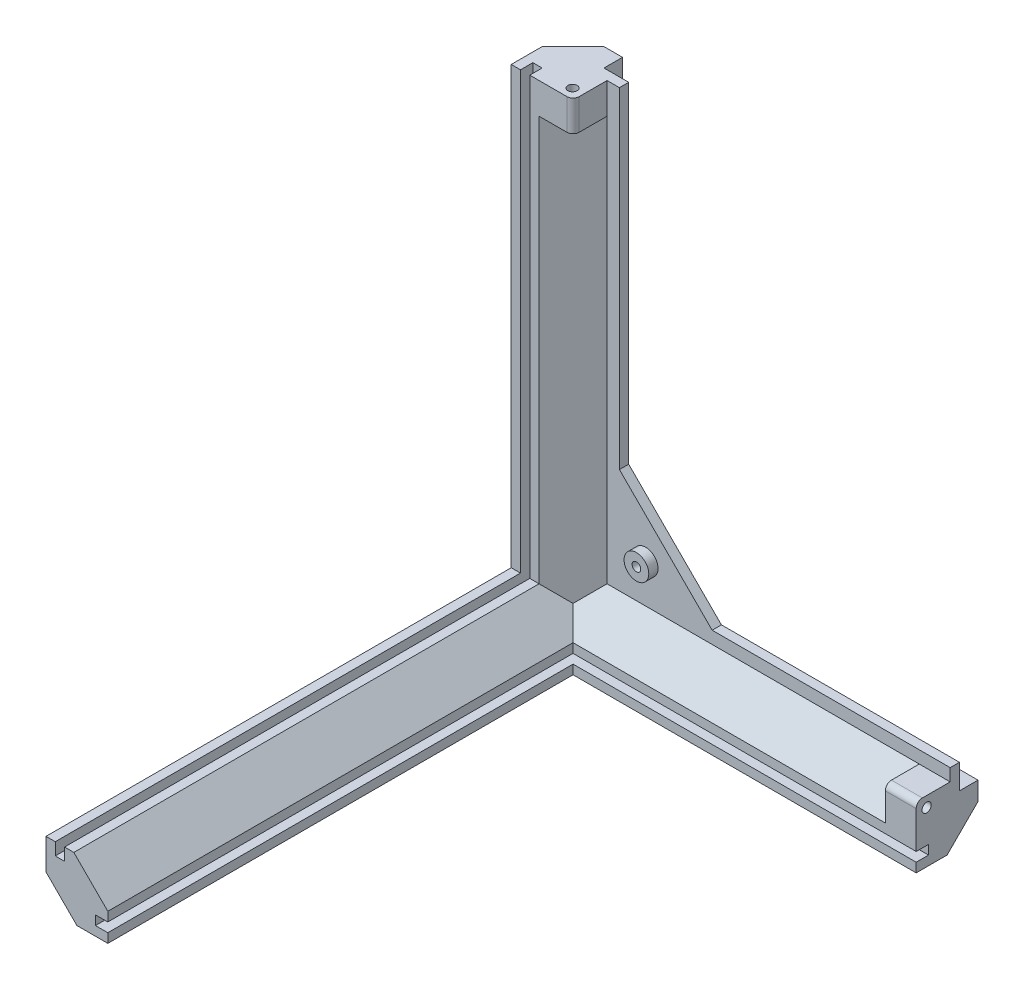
from build123d import *

# Parameters (mm, degrees)
BOSS_EXTRUDE1_DEPTH  = 141
BOSS_EXTRUDE2_DEPTH  = 150.5
BOSS_EXTRUDE3_DEPTH  = 111
SKETCH4_W            = 20
SKETCH4_H            = 20
BOSS_EXTRUDE4_DEPTH  = 20
CUT_EXTRUDE1_DEPTH   = 20
CUT_EXTRUDE2_DEPTH   = 20
CUT_EXTRUDE3_DEPTH   = 20
SKETCH8_W            = 4
SKETCH8_H            = 3
CUT_EXTRUDE4_DEPTH   = 4
SKETCH9_W            = 3
SKETCH9_H            = 4
CUT_EXTRUDE5_DEPTH   = 4
SKETCH10_W           = 3
SKETCH10_H           = 4
CUT_EXTRUDE6_DEPTH   = 4
CUT_EXTRUDE7_DEPTH   = 11
BOSS_EXTRUDE5_DEPTH  = 10
BOSS_EXTRUDE6_DEPTH  = 10
CUT_EXTRUDE9_DEPTH   = 231.152201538
SKETCH16_W           = 111
SKETCH16_H           = 3
BOSS_EXTRUDE7_DEPTH  = 4
SKETCH17_W           = 3
SKETCH17_H           = 137
BOSS_EXTRUDE8_DEPTH  = 4
CHAMFER1_SIZE        = 30
CHAMFER2_SIZE        = 20
SKETCH18_R           = 1.4
CUT_EXTRUDE10_DEPTH  = 228.978147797
SKETCH19_R           = 1.5
BOSS_EXTRUDE9_DEPTH  = 10
SKETCH20_R           = 1.5
BOSS_EXTRUDE10_DEPTH = 10
FILLET1_R            = 2
ESQUISSE1_R          = 4
ESQUISSE1_R_2        = 1.4
BOSS_EXTRU_1_DEPTH   = 3


with BuildPart() as part:
    # Sketch1 → Boss-Extrude1 (new body)
    with BuildSketch(Plane(origin=(0, 0, 0), x_dir=(1, 0, 0), z_dir=(0, 1, 0))):
        Polygon((-60.05786955, 3.452266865), (-50.05786955, 13.452266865), (-40.05786955, 13.452266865), (-40.05786955, 10.452266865), (-44.05786955, 10.452266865), (-44.05786955, 7.452266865), (-40.05786955, 7.452266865), (-40.05786955, 4.452266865), (-51.05786955, -6.547733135), (-54.05786955, -6.547733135), (-54.05786955, -2.547733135), (-57.05786955, -2.547733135), (-57.05786955, -6.547733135), (-60.05786955, -6.547733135), align=None)
    extrude(amount=BOSS_EXTRUDE1_DEPTH)



with BuildPart() as body_2:
    # Sketch2 → Boss-Extrude2 (new body)
    with BuildSketch(Plane.XY.offset(6.547733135)):
        Polygon((-57.05786955, 0), (-57.05786955, -4), (-54.05786955, -4), (-54.05786955, 0), (-51.05786955, 0), (-40.05786955, -11), (-40.05786955, -14), (-44.05786955, -14), (-44.05786955, -17), (-40.05786955, -17), (-40.05786955, -20), (-50.05786955, -20), (-60.05786955, -10), (-60.05786955, 0), align=None)
    extrude(amount=BOSS_EXTRUDE2_DEPTH)


with BuildPart() as body_3:
    # Sketch3 → Boss-Extrude3 (new body)
    with BuildSketch(Plane(origin=(-40.05786955, 0, 0), x_dir=(0, 0, -1), z_dir=(1, 0, 0))):
        Polygon((-6.547733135, -11), (-6.547733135, -14), (-2.547733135, -14), (-2.547733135, -17), (-6.547733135, -17), (-6.547733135, -20), (3.452266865, -20), (13.452266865, -10), (13.452266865, 0), (10.452266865, 0), (10.452266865, -4), (7.452266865, -4), (7.452266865, 0), (4.452266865, 0), align=None)
    extrude(amount=BOSS_EXTRUDE3_DEPTH)


with BuildPart() as part_1:
    add(part.part)

    add(body_2.part)  # Boss-Extrude4 merges body 2

    add(body_3.part)  # Boss-Extrude4 merges body 3
    # Sketch4 → Boss-Extrude4 (add)
    with BuildSketch(Plane(origin=(0, 0, -13.452266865), x_dir=(-1, 0, 0), z_dir=(0, 0, -1))):
        with Locations((50.05786955, -10)):
            Rectangle(SKETCH4_W, SKETCH4_H)
    extrude(amount=-BOSS_EXTRUDE4_DEPTH)

    # Sketch5 → Cut-Extrude1 (cut)
    with BuildSketch(Plane.XY.offset(6.547733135)):
        Polygon((-50.05786955, -20), (-60.05786955, -10), (-60.05786955, -20), align=None)
    extrude(amount=-CUT_EXTRUDE1_DEPTH, mode=Mode.SUBTRACT)

    # Sketch6 → Cut-Extrude2 (cut)
    with BuildSketch(Plane(origin=(0, 0, 0), x_dir=(1, 0, 0), z_dir=(0, 1, 0))):
        Polygon((-60.05786955, 3.452266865), (-50.05786955, 13.452266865), (-60.05786955, 13.452266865), align=None)
    extrude(amount=-CUT_EXTRUDE2_DEPTH, mode=Mode.SUBTRACT)

    # Sketch7 → Cut-Extrude3 (cut)
    with BuildSketch(Plane(origin=(-40.05786955, 0, 0), x_dir=(0, 0, -1), z_dir=(1, 0, 0))):
        Polygon((13.452266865, -10), (3.452266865, -20), (13.452266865, -20), align=None)
    extrude(amount=-CUT_EXTRUDE3_DEPTH, mode=Mode.SUBTRACT)

    # Sketch8 → Cut-Extrude4 (cut)
    with BuildSketch(Plane(origin=(-40.05786955, 0, 0), x_dir=(0, 0, -1), z_dir=(1, 0, 0))):
        with Locations((-4.547733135, -15.5)):
            Rectangle(SKETCH8_W, SKETCH8_H)
    extrude(amount=-CUT_EXTRUDE4_DEPTH, mode=Mode.SUBTRACT)

    # Sketch9 → Cut-Extrude5 (cut)
    with BuildSketch(Plane(origin=(-40.05786955, 0, 0), x_dir=(0, 0, -1), z_dir=(1, 0, 0))):
        with Locations((8.952266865, -2)):
            Rectangle(SKETCH9_W, SKETCH9_H)
    extrude(amount=-CUT_EXTRUDE5_DEPTH, mode=Mode.SUBTRACT)

    # Sketch10 → Cut-Extrude6 (cut)
    with BuildSketch(Plane(origin=(0, 0, 0), x_dir=(1, 0, 0), z_dir=(0, 1, 0))):
        with Locations((-55.55786955, -4.547733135)):
            Rectangle(SKETCH10_W, SKETCH10_H)
    extrude(amount=-CUT_EXTRUDE6_DEPTH, mode=Mode.SUBTRACT)

    # Sketch11 → Cut-Extrude7 (cut)
    with BuildSketch(Plane(origin=(0, 0, 0), x_dir=(1, 0, 0), z_dir=(0, 1, 0))):
        Polygon((-51.05786955, -6.547733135), (-40.05786955, 4.452266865), (-40.05786955, -6.547733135), align=None)
    extrude(amount=-CUT_EXTRUDE7_DEPTH, mode=Mode.SUBTRACT)

    # Sketch12 → Boss-Extrude5 (add)
    with BuildSketch(Plane.ZY.offset(40.05786955)):
        Polygon((6.547733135, -11), (-4.452266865, -11), (-4.452266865, 0), align=None)
    extrude(amount=BOSS_EXTRUDE5_DEPTH)

    # Sketch13 → Boss-Extrude6 (add)
    with BuildSketch(Plane(origin=(0, 0, 6.547733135), x_dir=(-1, 0, 0), z_dir=(0, 0, -1))):
        Polygon((40.05786955, -11), (51.05786955, -11), (51.05786955, 0), align=None)
    extrude(amount=BOSS_EXTRUDE6_DEPTH)

    # Sketch15 → Cut-Extrude9 (cut, through all)
    with BuildSketch(Plane.XY.offset(-10.452266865)):
        Polygon((-44.05786955, -4), (70.94213045, -4), (70.94213045, 0), (-40.05786955, 0), (-40.05786955, 141), (-44.05786955, 141), align=None)
    extrude(amount=-CUT_EXTRUDE9_DEPTH, mode=Mode.SUBTRACT)

    # Sketch16 → Boss-Extrude7 (add)
    with BuildSketch(Plane(origin=(0, 0, 0), x_dir=(1, 0, 0), z_dir=(0, 1, 0))):
        with Locations((15.44213045, 5.952266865)):
            Rectangle(SKETCH16_W, SKETCH16_H)
    extrude(amount=BOSS_EXTRUDE7_DEPTH)

    # Sketch17 → Boss-Extrude8 (add)
    with BuildSketch(Plane(origin=(-40.05786955, 0, 0), x_dir=(0, 0, -1), z_dir=(1, 0, 0))):
        with Locations((5.952266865, 72.5)):
            Rectangle(SKETCH17_W, SKETCH17_H)
    extrude(amount=BOSS_EXTRUDE8_DEPTH)

    # Chamfer1
    chamfer1_edges = [part_1.edges().sort_by_distance(p)[0] for p in [
        (-36.05786955, 4, -5.952266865),
    ]]
    chamfer(chamfer1_edges, length=CHAMFER1_SIZE)

    # Chamfer2
    chamfer2_edges = [part_1.edges().sort_by_distance(p)[0] for p in [
        (-44.05786955, -4, -10.452266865),
    ]]
    chamfer(chamfer2_edges, length=CHAMFER2_SIZE)

    # Sketch18 → Cut-Extrude10 (cut, through all)
    with BuildSketch(Plane(origin=(0, 0, -7.452266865), x_dir=(-1, 0, 0), z_dir=(0, 0, -1))):
        with Locations((27.55786955, 12.5)):
            Circle(SKETCH18_R)
    extrude(amount=-CUT_EXTRUDE10_DEPTH, mode=Mode.SUBTRACT)

    # Sketch19 → Boss-Extrude9 (add)
    with BuildSketch(Plane(origin=(70.94213045, 0, 0), x_dir=(0, 0, -1), z_dir=(1, 0, 0))):
        Polygon((4.452266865, 0), (-6.547733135, 0), (-6.547733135, -11), align=None)
        with Locations((-3.169053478, -3.378679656)):
            Circle(SKETCH19_R, mode=Mode.SUBTRACT)
    extrude(amount=-BOSS_EXTRUDE9_DEPTH)

    # Sketch20 → Boss-Extrude10 (add)
    with BuildSketch(Plane(origin=(0, 141, 0), x_dir=(1, 0, 0), z_dir=(0, 1, 0))):
        Polygon((-40.05786955, 4.452266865), (-40.05786955, -6.547733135), (-51.05786955, -6.547733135), align=None)
        with Locations(Location((-43.516009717, -3.248513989, 0), (0, 0, 270))):
            Circle(SKETCH20_R, mode=Mode.SUBTRACT)
    extrude(amount=-BOSS_EXTRUDE10_DEPTH)

    # Fillet1
    fillet1_edges = [part_1.edges().sort_by_distance(p)[0] for p in [
        (65.94213045, 0, 6.547733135),
        (-40.05786955, 136, 6.547733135),
    ]]
    fillet(fillet1_edges, radius=FILLET1_R)

    # Esquisse1 → Boss.-Extru.1 (add)
    with BuildSketch(Plane.XY.offset(-4.452266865)):
        with Locations(Location((-27.55786955, 12.5, 0), (0, 0, 180))):
            Circle(ESQUISSE1_R)
        with Locations(Location((-27.55786955, 12.5, 0), (0, 0, 180))):
            Circle(ESQUISSE1_R_2, mode=Mode.SUBTRACT)
    extrude(amount=BOSS_EXTRU_1_DEPTH)


solid = part_1.part
